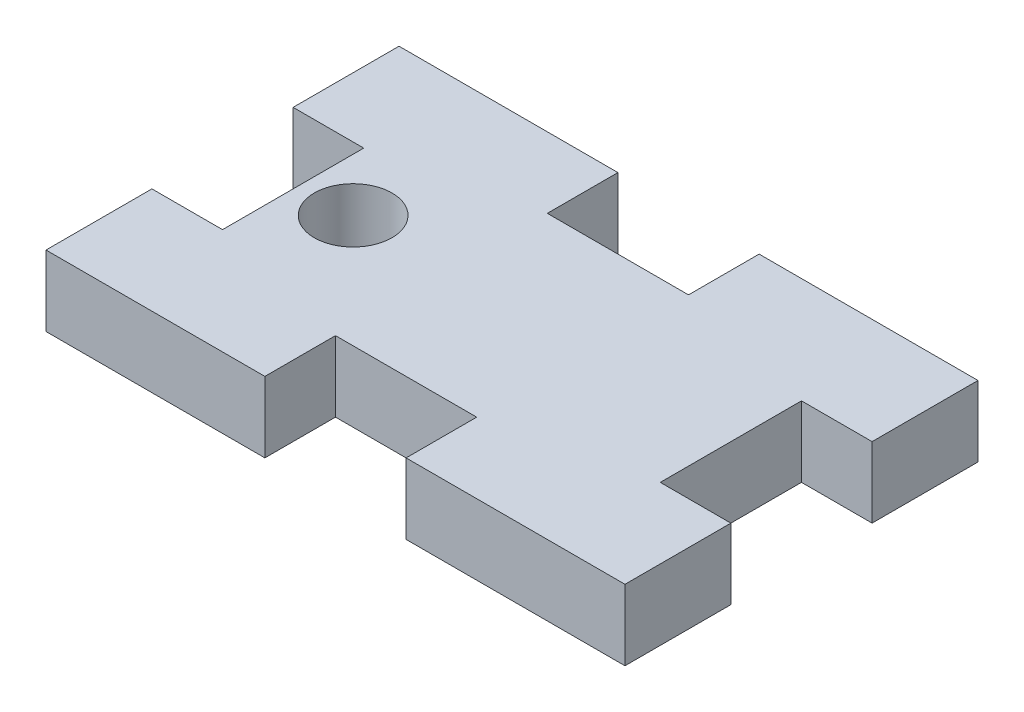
from build123d import *

# Parameters (mm, degrees)
ESQUISSE1_W             = 41
ESQUISSE1_H             = 25
BOSS_EXTRU_1_DEPTH      = 5
ESQUISSE2_W             = 10
ESQUISSE2_H             = 5
ENL_V_MAT_EXTRU_1_DEPTH = 5
ENL_V_MAT_EXTRU_2_REACH = 26.525
ESQUISSE3_W             = 5
ESQUISSE3_H             = 10
ENL_V_MAT_EXTRU_3_REACH = 26.525
ESQUISSE4_R             = 2.75


with BuildPart() as part:
    # Esquisse1 → Boss.-Extru.1 (new body)
    with BuildSketch(Plane(origin=(0, 0, 0), x_dir=(1, 0, 0), z_dir=(0, 1, 0))):
        Rectangle(ESQUISSE1_W, ESQUISSE1_H)
    extrude(amount=BOSS_EXTRU_1_DEPTH)

    # Esquisse2 → Enl_v. mat.-Extru.1 (cut)
    with BuildSketch(Plane(origin=(0, 5, 0), x_dir=(1, 0, 0), z_dir=(0, 1, 0))):
        with Locations((0, -10)):
            Rectangle(ESQUISSE2_W, ESQUISSE2_H)
    enl_v_mat_extru_1 = extrude(amount=-ENL_V_MAT_EXTRU_1_DEPTH, mode=Mode.SUBTRACT)

    # Sym_trie1: Enl_v. mat.-Extru.1 across plane
    add(enl_v_mat_extru_1.mirror(Plane.XY), mode=Mode.SUBTRACT)

    # Esquisse3 → Enl_v. mat.-Extru.2 (cut, up to next)
    with BuildSketch(Plane(origin=(0, 5, 0), x_dir=(1, 0, 0), z_dir=(0, 1, 0)), mode=Mode.PRIVATE) as enl_v_mat_extru_2_sk1:
        with Locations((-18, 0)):
            Rectangle(ESQUISSE3_W, ESQUISSE3_H)
    enl_v_mat_extru_2_tool1 = extrude(enl_v_mat_extru_2_sk1.sketch, amount=-ENL_V_MAT_EXTRU_2_REACH, mode=Mode.PRIVATE) & part.part
    enl_v_mat_extru_2 = enl_v_mat_extru_2_tool1.solids().sort_by_distance((-18, 5, 0))[0]
    add(enl_v_mat_extru_2, mode=Mode.SUBTRACT)

    # Sym_trie2: Enl_v. mat.-Extru.2 across plane
    add(enl_v_mat_extru_2.mirror(Plane(origin=(0, 0, 0), x_dir=(0, 0, 1), z_dir=(1, 0, 0))), mode=Mode.SUBTRACT)

    # Esquisse4 → Enl_v. mat.-Extru.3 (cut, up to next)
    with BuildSketch(Plane(origin=(0, 5, 0), x_dir=(1, 0, 0), z_dir=(0, 1, 0)), mode=Mode.PRIVATE) as enl_v_mat_extru_3_sk1:
        with Locations(Location((-11.75, 0.5, 0), (0, 0, 270))):
            Circle(ESQUISSE4_R)
    enl_v_mat_extru_3_tool1 = extrude(enl_v_mat_extru_3_sk1.sketch, amount=-ENL_V_MAT_EXTRU_3_REACH, mode=Mode.PRIVATE) & part.part
    add(enl_v_mat_extru_3_tool1.solids().sort_by_distance((-11.75, 5, -0.5))[0], mode=Mode.SUBTRACT)


solid = part.part
